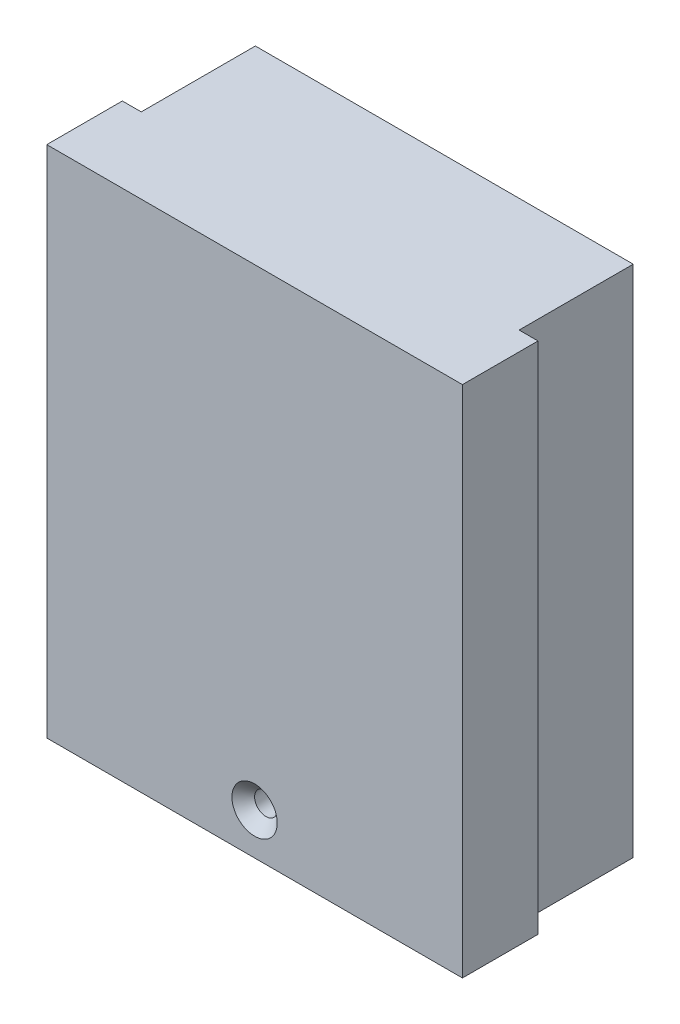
ISO-10303-21;
HEADER;
FILE_DESCRIPTION(('STEP AP214'),'2;1');
FILE_NAME('part.step','',(''),(''),'','','');
FILE_SCHEMA(('AUTOMOTIVE_DESIGN { 1 0 10303 214 1 1 1 1 }'));
ENDSEC;
DATA;
#1=APPLICATION_CONTEXT('core data for automotive mechanical design processes');
#2=APPLICATION_PROTOCOL_DEFINITION('international standard','automotive_design',2000,#1);
#3=PRODUCT_CONTEXT('',#1,'mechanical');
#4=PRODUCT('Part','Part','',(#3));
#5=PRODUCT_RELATED_PRODUCT_CATEGORY('part','',(#4));
#6=PRODUCT_DEFINITION_FORMATION('','',#4);
#7=PRODUCT_DEFINITION_CONTEXT('part definition',#1,'design');
#8=PRODUCT_DEFINITION('design','',#6,#7);
#9=PRODUCT_DEFINITION_SHAPE('','',#8);
#10=(LENGTH_UNIT() NAMED_UNIT(*) SI_UNIT(.MILLI.,.METRE.));
#11=(NAMED_UNIT(*) PLANE_ANGLE_UNIT() SI_UNIT($,.RADIAN.));
#12=(NAMED_UNIT(*) SI_UNIT($,.STERADIAN.) SOLID_ANGLE_UNIT());
#13=UNCERTAINTY_MEASURE_WITH_UNIT(LENGTH_MEASURE(1.E-05),#10,'distance_accuracy_value','');
#14=(GEOMETRIC_REPRESENTATION_CONTEXT(3) GLOBAL_UNCERTAINTY_ASSIGNED_CONTEXT((#13)) GLOBAL_UNIT_ASSIGNED_CONTEXT((#10,
#11,#12)) REPRESENTATION_CONTEXT('',''));
#15=CARTESIAN_POINT('',(0.,0.,0.));
#16=DIRECTION('',(0.,0.,1.));
#17=DIRECTION('',(1.,0.,0.));
#18=AXIS2_PLACEMENT_3D('',#15,#16,#17);
#19=CARTESIAN_POINT('',(27.5,68.,-10.));
#20=DIRECTION('',(-1.,0.,0.));
#21=DIRECTION('',(0.,0.,1.));
#22=AXIS2_PLACEMENT_3D('',#19,#20,#21);
#23=PLANE('',#22);
#24=DIRECTION('',(0.,0.,-1.));
#25=VECTOR('',#24,1.);
#26=CARTESIAN_POINT('',(27.5,0.,-10.));
#27=LINE('',#26,#25);
#28=CARTESIAN_POINT('',(27.5,0.,0.));
#29=VERTEX_POINT('',#28);
#30=CARTESIAN_POINT('',(27.5,0.,-10.));
#31=VERTEX_POINT('',#30);
#32=EDGE_CURVE('E128',#29,#31,#27,.T.);
#33=ORIENTED_EDGE('',*,*,#32,.T.);
#34=DIRECTION('',(0.,-1.,0.));
#35=VECTOR('',#34,1.);
#36=CARTESIAN_POINT('',(27.5,68.,-10.));
#37=LINE('',#36,#35);
#38=CARTESIAN_POINT('',(27.5,68.,-10.));
#39=VERTEX_POINT('',#38);
#40=EDGE_CURVE('E11',#39,#31,#37,.T.);
#41=ORIENTED_EDGE('',*,*,#40,.F.);
#42=DIRECTION('',(0.,0.,-1.));
#43=VECTOR('',#42,1.);
#44=CARTESIAN_POINT('',(27.5,68.,-10.));
#45=LINE('',#44,#43);
#46=CARTESIAN_POINT('',(27.5,68.,0.));
#47=VERTEX_POINT('',#46);
#48=EDGE_CURVE('E143',#47,#39,#45,.T.);
#49=ORIENTED_EDGE('',*,*,#48,.F.);
#50=DIRECTION('',(0.,-1.,0.));
#51=VECTOR('',#50,1.);
#52=CARTESIAN_POINT('',(27.5,68.,0.));
#53=LINE('',#52,#51);
#54=EDGE_CURVE('E124',#47,#29,#53,.T.);
#55=ORIENTED_EDGE('',*,*,#54,.T.);
#56=EDGE_LOOP('',(#33,#41,#49,#55));
#57=FACE_BOUND('',#56,.T.);
#58=ADVANCED_FACE('F32',(#57),#23,.F.);
#59=CARTESIAN_POINT('',(27.5,68.,-10.));
#60=DIRECTION('',(0.,0.,1.));
#61=DIRECTION('',(1.,0.,0.));
#62=AXIS2_PLACEMENT_3D('',#59,#60,#61);
#63=PLANE('',#62);
#64=DIRECTION('',(-1.,0.,0.));
#65=VECTOR('',#64,1.);
#66=CARTESIAN_POINT('',(27.5,0.,-10.));
#67=LINE('',#66,#65);
#68=CARTESIAN_POINT('',(25.,0.,-10.));
#69=VERTEX_POINT('',#68);
#70=EDGE_CURVE('E131',#31,#69,#67,.T.);
#71=ORIENTED_EDGE('',*,*,#70,.T.);
#72=DIRECTION('',(0.,-1.,0.));
#73=VECTOR('',#72,1.);
#74=CARTESIAN_POINT('',(25.,68.,-10.));
#75=LINE('',#74,#73);
#76=CARTESIAN_POINT('',(25.,68.,-10.));
#77=VERTEX_POINT('',#76);
#78=EDGE_CURVE('E40',#77,#69,#75,.T.);
#79=ORIENTED_EDGE('',*,*,#78,.F.);
#80=DIRECTION('',(-1.,0.,0.));
#81=VECTOR('',#80,1.);
#82=CARTESIAN_POINT('',(27.5,68.,-10.));
#83=LINE('',#82,#81);
#84=EDGE_CURVE('E91',#39,#77,#83,.T.);
#85=ORIENTED_EDGE('',*,*,#84,.F.);
#86=ORIENTED_EDGE('',*,*,#40,.T.);
#87=EDGE_LOOP('',(#71,#79,#85,#86));
#88=FACE_BOUND('',#87,.T.);
#89=ADVANCED_FACE('F201',(#88),#63,.F.);
#90=CARTESIAN_POINT('',(25.,68.,-25.1));
#91=DIRECTION('',(-1.,0.,0.));
#92=DIRECTION('',(0.,0.,1.));
#93=AXIS2_PLACEMENT_3D('',#90,#91,#92);
#94=PLANE('',#93);
#95=DIRECTION('',(0.,0.,-1.));
#96=VECTOR('',#95,1.);
#97=CARTESIAN_POINT('',(25.,0.,-25.1));
#98=LINE('',#97,#96);
#99=CARTESIAN_POINT('',(25.,0.,-25.1));
#100=VERTEX_POINT('',#99);
#101=EDGE_CURVE('E134',#69,#100,#98,.T.);
#102=ORIENTED_EDGE('',*,*,#101,.T.);
#103=DIRECTION('',(0.,-1.,0.));
#104=VECTOR('',#103,1.);
#105=CARTESIAN_POINT('',(25.,68.,-25.1));
#106=LINE('',#105,#104);
#107=CARTESIAN_POINT('',(25.,68.,-25.1));
#108=VERTEX_POINT('',#107);
#109=EDGE_CURVE('E150',#108,#100,#106,.T.);
#110=ORIENTED_EDGE('',*,*,#109,.F.);
#111=DIRECTION('',(0.,0.,-1.));
#112=VECTOR('',#111,1.);
#113=CARTESIAN_POINT('',(25.,68.,-25.1));
#114=LINE('',#113,#112);
#115=EDGE_CURVE('E158',#77,#108,#114,.T.);
#116=ORIENTED_EDGE('',*,*,#115,.F.);
#117=ORIENTED_EDGE('',*,*,#78,.T.);
#118=EDGE_LOOP('',(#102,#110,#116,#117));
#119=FACE_BOUND('',#118,.T.);
#120=ADVANCED_FACE('F156',(#119),#94,.F.);
#121=CARTESIAN_POINT('',(-25.,68.,-25.1));
#122=DIRECTION('',(0.,0.,1.));
#123=DIRECTION('',(1.,0.,0.));
#124=AXIS2_PLACEMENT_3D('',#121,#122,#123);
#125=PLANE('',#124);
#126=CARTESIAN_POINT('',(0.,5.5,-25.1));
#127=DIRECTION('',(0.,0.,1.));
#128=DIRECTION('',(1.,0.,0.));
#129=AXIS2_PLACEMENT_3D('',#126,#127,#128);
#130=CIRCLE('',#129,2.32413016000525);
#131=CARTESIAN_POINT('',(2.32413016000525,5.5,-25.1));
#132=VERTEX_POINT('',#131);
#133=EDGE_CURVE('E132',#132,#132,#130,.T.);
#134=ORIENTED_EDGE('',*,*,#133,.T.);
#135=EDGE_LOOP('',(#134));
#136=FACE_BOUND('',#135,.T.);
#137=DIRECTION('',(-1.,0.,0.));
#138=VECTOR('',#137,1.);
#139=CARTESIAN_POINT('',(-25.,0.,-25.1));
#140=LINE('',#139,#138);
#141=CARTESIAN_POINT('',(-25.,0.,-25.1));
#142=VERTEX_POINT('',#141);
#143=EDGE_CURVE('E136',#100,#142,#140,.T.);
#144=ORIENTED_EDGE('',*,*,#143,.T.);
#145=DIRECTION('',(0.,-1.,0.));
#146=VECTOR('',#145,1.);
#147=CARTESIAN_POINT('',(-25.,68.,-25.1));
#148=LINE('',#147,#146);
#149=CARTESIAN_POINT('',(-25.,68.,-25.1));
#150=VERTEX_POINT('',#149);
#151=EDGE_CURVE('E147',#150,#142,#148,.T.);
#152=ORIENTED_EDGE('',*,*,#151,.F.);
#153=DIRECTION('',(-1.,0.,0.));
#154=VECTOR('',#153,1.);
#155=CARTESIAN_POINT('',(-25.,68.,-25.1));
#156=LINE('',#155,#154);
#157=EDGE_CURVE('E170',#108,#150,#156,.T.);
#158=ORIENTED_EDGE('',*,*,#157,.F.);
#159=ORIENTED_EDGE('',*,*,#109,.T.);
#160=EDGE_LOOP('',(#144,#152,#158,#159));
#161=FACE_BOUND('',#160,.T.);
#162=ADVANCED_FACE('F166',(#136,#161),#125,.F.);
#163=CARTESIAN_POINT('',(-25.,68.,-25.1));
#164=DIRECTION('',(1.,0.,0.));
#165=DIRECTION('',(0.,0.,-1.));
#166=AXIS2_PLACEMENT_3D('',#163,#164,#165);
#167=PLANE('',#166);
#168=DIRECTION('',(0.,0.,1.));
#169=VECTOR('',#168,1.);
#170=CARTESIAN_POINT('',(-25.,0.,-25.1));
#171=LINE('',#170,#169);
#172=CARTESIAN_POINT('',(-25.,0.,-10.));
#173=VERTEX_POINT('',#172);
#174=EDGE_CURVE('E138',#142,#173,#171,.T.);
#175=ORIENTED_EDGE('',*,*,#174,.T.);
#176=DIRECTION('',(0.,-1.,0.));
#177=VECTOR('',#176,1.);
#178=CARTESIAN_POINT('',(-25.,68.,-10.));
#179=LINE('',#178,#177);
#180=CARTESIAN_POINT('',(-25.,68.,-10.));
#181=VERTEX_POINT('',#180);
#182=EDGE_CURVE('E119',#181,#173,#179,.T.);
#183=ORIENTED_EDGE('',*,*,#182,.F.);
#184=DIRECTION('',(0.,0.,1.));
#185=VECTOR('',#184,1.);
#186=CARTESIAN_POINT('',(-25.,68.,-25.1));
#187=LINE('',#186,#185);
#188=EDGE_CURVE('E110',#150,#181,#187,.T.);
#189=ORIENTED_EDGE('',*,*,#188,.F.);
#190=ORIENTED_EDGE('',*,*,#151,.T.);
#191=EDGE_LOOP('',(#175,#183,#189,#190));
#192=FACE_BOUND('',#191,.T.);
#193=ADVANCED_FACE('F169',(#192),#167,.F.);
#194=CARTESIAN_POINT('',(-27.5,68.,-10.));
#195=DIRECTION('',(0.,0.,1.));
#196=DIRECTION('',(1.,0.,0.));
#197=AXIS2_PLACEMENT_3D('',#194,#195,#196);
#198=PLANE('',#197);
#199=DIRECTION('',(-1.,0.,0.));
#200=VECTOR('',#199,1.);
#201=CARTESIAN_POINT('',(-27.5,0.,-10.));
#202=LINE('',#201,#200);
#203=CARTESIAN_POINT('',(-27.5,0.,-10.));
#204=VERTEX_POINT('',#203);
#205=EDGE_CURVE('E118',#173,#204,#202,.T.);
#206=ORIENTED_EDGE('',*,*,#205,.T.);
#207=DIRECTION('',(0.,-1.,0.));
#208=VECTOR('',#207,1.);
#209=CARTESIAN_POINT('',(-27.5,68.,-10.));
#210=LINE('',#209,#208);
#211=CARTESIAN_POINT('',(-27.5,68.,-10.));
#212=VERTEX_POINT('',#211);
#213=EDGE_CURVE('E115',#212,#204,#210,.T.);
#214=ORIENTED_EDGE('',*,*,#213,.F.);
#215=DIRECTION('',(-1.,0.,0.));
#216=VECTOR('',#215,1.);
#217=CARTESIAN_POINT('',(-27.5,68.,-10.));
#218=LINE('',#217,#216);
#219=EDGE_CURVE('E104',#181,#212,#218,.T.);
#220=ORIENTED_EDGE('',*,*,#219,.F.);
#221=ORIENTED_EDGE('',*,*,#182,.T.);
#222=EDGE_LOOP('',(#206,#214,#220,#221));
#223=FACE_BOUND('',#222,.T.);
#224=ADVANCED_FACE('F116',(#223),#198,.F.);
#225=CARTESIAN_POINT('',(-27.5,68.,-10.));
#226=DIRECTION('',(1.,0.,0.));
#227=DIRECTION('',(0.,0.,-1.));
#228=AXIS2_PLACEMENT_3D('',#225,#226,#227);
#229=PLANE('',#228);
#230=DIRECTION('',(0.,0.,1.));
#231=VECTOR('',#230,1.);
#232=CARTESIAN_POINT('',(-27.5,0.,-10.));
#233=LINE('',#232,#231);
#234=CARTESIAN_POINT('',(-27.5,0.,0.));
#235=VERTEX_POINT('',#234);
#236=EDGE_CURVE('E77',#204,#235,#233,.T.);
#237=ORIENTED_EDGE('',*,*,#236,.T.);
#238=DIRECTION('',(0.,-1.,0.));
#239=VECTOR('',#238,1.);
#240=CARTESIAN_POINT('',(-27.5,68.,0.));
#241=LINE('',#240,#239);
#242=CARTESIAN_POINT('',(-27.5,68.,0.));
#243=VERTEX_POINT('',#242);
#244=EDGE_CURVE('E120',#243,#235,#241,.T.);
#245=ORIENTED_EDGE('',*,*,#244,.F.);
#246=DIRECTION('',(0.,0.,1.));
#247=VECTOR('',#246,1.);
#248=CARTESIAN_POINT('',(-27.5,68.,-10.));
#249=LINE('',#248,#247);
#250=EDGE_CURVE('E108',#212,#243,#249,.T.);
#251=ORIENTED_EDGE('',*,*,#250,.F.);
#252=ORIENTED_EDGE('',*,*,#213,.T.);
#253=EDGE_LOOP('',(#237,#245,#251,#252));
#254=FACE_BOUND('',#253,.T.);
#255=ADVANCED_FACE('F122',(#254),#229,.F.);
#256=CARTESIAN_POINT('',(-27.5,68.,0.));
#257=DIRECTION('',(0.,0.,-1.));
#258=DIRECTION('',(-1.,0.,0.));
#259=AXIS2_PLACEMENT_3D('',#256,#257,#258);
#260=PLANE('',#259);
#261=CARTESIAN_POINT('',(0.,5.5,0.));
#262=DIRECTION('',(0.,0.,-1.));
#263=DIRECTION('',(-1.,0.,0.));
#264=AXIS2_PLACEMENT_3D('',#261,#262,#263);
#265=CIRCLE('',#264,3.00000000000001);
#266=CARTESIAN_POINT('',(-3.00000000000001,5.5,0.));
#267=VERTEX_POINT('',#266);
#268=EDGE_CURVE('E178',#267,#267,#265,.T.);
#269=ORIENTED_EDGE('',*,*,#268,.T.);
#270=EDGE_LOOP('',(#269));
#271=FACE_BOUND('',#270,.T.);
#272=DIRECTION('',(1.,0.,0.));
#273=VECTOR('',#272,1.);
#274=CARTESIAN_POINT('',(-27.5,0.,0.));
#275=LINE('',#274,#273);
#276=EDGE_CURVE('E83',#235,#29,#275,.T.);
#277=ORIENTED_EDGE('',*,*,#276,.T.);
#278=ORIENTED_EDGE('',*,*,#54,.F.);
#279=DIRECTION('',(1.,0.,0.));
#280=VECTOR('',#279,1.);
#281=CARTESIAN_POINT('',(-27.5,68.,0.));
#282=LINE('',#281,#280);
#283=EDGE_CURVE('E48',#243,#47,#282,.T.);
#284=ORIENTED_EDGE('',*,*,#283,.F.);
#285=ORIENTED_EDGE('',*,*,#244,.T.);
#286=EDGE_LOOP('',(#277,#278,#284,#285));
#287=FACE_BOUND('',#286,.T.);
#288=ADVANCED_FACE('F208',(#271,#287),#260,.F.);
#289=CARTESIAN_POINT('',(0.,68.,0.));
#290=DIRECTION('',(0.,1.,0.));
#291=DIRECTION('',(0.,0.,1.));
#292=AXIS2_PLACEMENT_3D('',#289,#290,#291);
#293=PLANE('',#292);
#294=ORIENTED_EDGE('',*,*,#48,.T.);
#295=ORIENTED_EDGE('',*,*,#84,.T.);
#296=ORIENTED_EDGE('',*,*,#115,.T.);
#297=ORIENTED_EDGE('',*,*,#157,.T.);
#298=ORIENTED_EDGE('',*,*,#188,.T.);
#299=ORIENTED_EDGE('',*,*,#219,.T.);
#300=ORIENTED_EDGE('',*,*,#250,.T.);
#301=ORIENTED_EDGE('',*,*,#283,.T.);
#302=EDGE_LOOP('',(#294,#295,#296,#297,#298,#299,#300,#301));
#303=FACE_BOUND('',#302,.T.);
#304=ADVANCED_FACE('F106',(#303),#293,.T.);
#305=CARTESIAN_POINT('',(0.,0.,0.));
#306=DIRECTION('',(0.,1.,0.));
#307=DIRECTION('',(0.,0.,1.));
#308=AXIS2_PLACEMENT_3D('',#305,#306,#307);
#309=PLANE('',#308);
#310=ORIENTED_EDGE('',*,*,#32,.F.);
#311=ORIENTED_EDGE('',*,*,#276,.F.);
#312=ORIENTED_EDGE('',*,*,#236,.F.);
#313=ORIENTED_EDGE('',*,*,#205,.F.);
#314=ORIENTED_EDGE('',*,*,#174,.F.);
#315=ORIENTED_EDGE('',*,*,#143,.F.);
#316=ORIENTED_EDGE('',*,*,#101,.F.);
#317=ORIENTED_EDGE('',*,*,#70,.F.);
#318=EDGE_LOOP('',(#310,#311,#312,#313,#314,#315,#316,#317));
#319=FACE_BOUND('',#318,.T.);
#320=ADVANCED_FACE('F162',(#319),#309,.F.);
#321=CARTESIAN_POINT('',(0.,5.5,-1.5));
#322=DIRECTION('',(0.,0.,-1.));
#323=DIRECTION('',(1.,0.,0.));
#324=AXIS2_PLACEMENT_3D('',#321,#322,#323);
#325=CONICAL_SURFACE('',#324,1.5,0.0349065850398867);
#326=ORIENTED_EDGE('',*,*,#133,.F.);
#327=EDGE_LOOP('',(#326));
#328=FACE_BOUND('',#327,.T.);
#329=CARTESIAN_POINT('',(0.,5.5,-1.5));
#330=DIRECTION('',(0.,0.,-1.));
#331=DIRECTION('',(-1.,0.,0.));
#332=AXIS2_PLACEMENT_3D('',#329,#330,#331);
#333=CIRCLE('',#332,1.5);
#334=CARTESIAN_POINT('',(-1.5,5.5,-1.5));
#335=VERTEX_POINT('',#334);
#336=EDGE_CURVE('E181',#335,#335,#333,.T.);
#337=ORIENTED_EDGE('',*,*,#336,.F.);
#338=EDGE_LOOP('',(#337));
#339=FACE_BOUND('',#338,.T.);
#340=ADVANCED_FACE('F187',(#328,#339),#325,.F.);
#341=CARTESIAN_POINT('',(0.,5.5,-1.5));
#342=DIRECTION('',(0.,0.,1.));
#343=DIRECTION('',(-1.,0.,0.));
#344=AXIS2_PLACEMENT_3D('',#341,#342,#343);
#345=CONICAL_SURFACE('',#344,1.5,0.78539816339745);
#346=ORIENTED_EDGE('',*,*,#268,.F.);
#347=EDGE_LOOP('',(#346));
#348=FACE_BOUND('',#347,.T.);
#349=ORIENTED_EDGE('',*,*,#336,.T.);
#350=EDGE_LOOP('',(#349));
#351=FACE_BOUND('',#350,.T.);
#352=ADVANCED_FACE('F185',(#348,#351),#345,.F.);
#353=CLOSED_SHELL('',(#58,#89,#120,#162,#193,#224,#255,#288,#304,#320,#340,#352));
#354=MANIFOLD_SOLID_BREP('B2',#353);
#355=ADVANCED_BREP_SHAPE_REPRESENTATION('',(#18,#354),#14);
#356=SHAPE_DEFINITION_REPRESENTATION(#9,#355);
ENDSEC;
END-ISO-10303-21;
